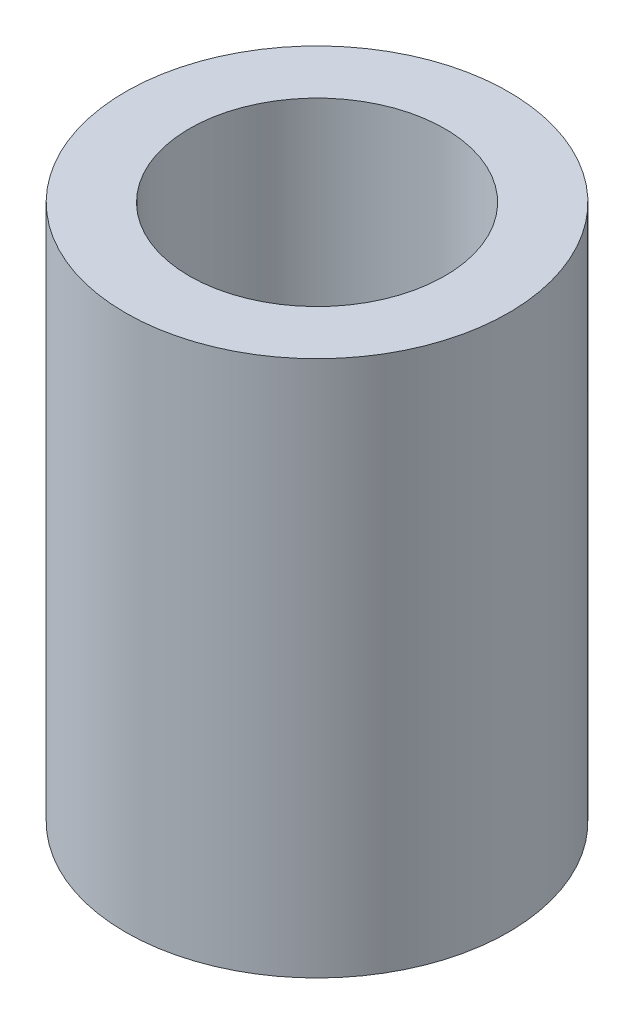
ISO-10303-21;
HEADER;
FILE_DESCRIPTION(('STEP AP214'),'2;1');
FILE_NAME('part.step','',(''),(''),'','','');
FILE_SCHEMA(('AUTOMOTIVE_DESIGN { 1 0 10303 214 1 1 1 1 }'));
ENDSEC;
DATA;
#1=APPLICATION_CONTEXT('core data for automotive mechanical design processes');
#2=APPLICATION_PROTOCOL_DEFINITION('international standard','automotive_design',2000,#1);
#3=PRODUCT_CONTEXT('',#1,'mechanical');
#4=PRODUCT('Part','Part','',(#3));
#5=PRODUCT_RELATED_PRODUCT_CATEGORY('part','',(#4));
#6=PRODUCT_DEFINITION_FORMATION('','',#4);
#7=PRODUCT_DEFINITION_CONTEXT('part definition',#1,'design');
#8=PRODUCT_DEFINITION('design','',#6,#7);
#9=PRODUCT_DEFINITION_SHAPE('','',#8);
#10=(LENGTH_UNIT() NAMED_UNIT(*) SI_UNIT(.MILLI.,.METRE.));
#11=(NAMED_UNIT(*) PLANE_ANGLE_UNIT() SI_UNIT($,.RADIAN.));
#12=(NAMED_UNIT(*) SI_UNIT($,.STERADIAN.) SOLID_ANGLE_UNIT());
#13=UNCERTAINTY_MEASURE_WITH_UNIT(LENGTH_MEASURE(1.E-05),#10,'distance_accuracy_value','');
#14=(GEOMETRIC_REPRESENTATION_CONTEXT(3) GLOBAL_UNCERTAINTY_ASSIGNED_CONTEXT((#13)) GLOBAL_UNIT_ASSIGNED_CONTEXT((#10,
#11,#12)) REPRESENTATION_CONTEXT('',''));
#15=CARTESIAN_POINT('',(0.,0.,0.));
#16=DIRECTION('',(0.,0.,1.));
#17=DIRECTION('',(1.,0.,0.));
#18=AXIS2_PLACEMENT_3D('',#15,#16,#17);
#19=CARTESIAN_POINT('',(0.,4.2,0.));
#20=DIRECTION('',(0.,1.,0.));
#21=DIRECTION('',(0.,0.,1.));
#22=AXIS2_PLACEMENT_3D('',#19,#20,#21);
#23=PLANE('',#22);
#24=CARTESIAN_POINT('',(0.,4.2,0.));
#25=DIRECTION('',(0.,1.,0.));
#26=DIRECTION('',(0.,0.,1.));
#27=AXIS2_PLACEMENT_3D('',#24,#25,#26);
#28=CIRCLE('',#27,1.5);
#29=CARTESIAN_POINT('',(0.,4.2,1.5));
#30=VERTEX_POINT('',#29);
#31=EDGE_CURVE('E10',#30,#30,#28,.T.);
#32=ORIENTED_EDGE('',*,*,#31,.T.);
#33=EDGE_LOOP('',(#32));
#34=FACE_BOUND('',#33,.T.);
#35=CARTESIAN_POINT('',(0.,4.2,0.));
#36=DIRECTION('',(0.,1.,0.));
#37=DIRECTION('',(0.,0.,1.));
#38=AXIS2_PLACEMENT_3D('',#35,#36,#37);
#39=CIRCLE('',#38,1.);
#40=CARTESIAN_POINT('',(0.,4.2,1.));
#41=VERTEX_POINT('',#40);
#42=EDGE_CURVE('E43',#41,#41,#39,.T.);
#43=ORIENTED_EDGE('',*,*,#42,.F.);
#44=EDGE_LOOP('',(#43));
#45=FACE_BOUND('',#44,.T.);
#46=ADVANCED_FACE('F32',(#34,#45),#23,.T.);
#47=CARTESIAN_POINT('',(0.,0.,0.));
#48=DIRECTION('',(0.,1.,0.));
#49=DIRECTION('',(0.,0.,1.));
#50=AXIS2_PLACEMENT_3D('',#47,#48,#49);
#51=PLANE('',#50);
#52=CARTESIAN_POINT('',(0.,0.,0.));
#53=DIRECTION('',(0.,1.,0.));
#54=DIRECTION('',(0.,0.,1.));
#55=AXIS2_PLACEMENT_3D('',#52,#53,#54);
#56=CIRCLE('',#55,1.5);
#57=CARTESIAN_POINT('',(0.,0.,1.5));
#58=VERTEX_POINT('',#57);
#59=EDGE_CURVE('E36',#58,#58,#56,.T.);
#60=ORIENTED_EDGE('',*,*,#59,.F.);
#61=EDGE_LOOP('',(#60));
#62=FACE_BOUND('',#61,.T.);
#63=CARTESIAN_POINT('',(0.,0.,0.));
#64=DIRECTION('',(0.,1.,0.));
#65=DIRECTION('',(0.,0.,1.));
#66=AXIS2_PLACEMENT_3D('',#63,#64,#65);
#67=CIRCLE('',#66,1.);
#68=CARTESIAN_POINT('',(0.,0.,1.));
#69=VERTEX_POINT('',#68);
#70=EDGE_CURVE('E45',#69,#69,#67,.T.);
#71=ORIENTED_EDGE('',*,*,#70,.T.);
#72=EDGE_LOOP('',(#71));
#73=FACE_BOUND('',#72,.T.);
#74=ADVANCED_FACE('F55',(#62,#73),#51,.F.);
#75=CARTESIAN_POINT('',(0.,4.2,0.));
#76=DIRECTION('',(0.,-1.,0.));
#77=DIRECTION('',(0.,0.,-1.));
#78=AXIS2_PLACEMENT_3D('',#75,#76,#77);
#79=CYLINDRICAL_SURFACE('',#78,1.5);
#80=ORIENTED_EDGE('',*,*,#31,.F.);
#81=EDGE_LOOP('',(#80));
#82=FACE_BOUND('',#81,.T.);
#83=ORIENTED_EDGE('',*,*,#59,.T.);
#84=EDGE_LOOP('',(#83));
#85=FACE_BOUND('',#84,.T.);
#86=ADVANCED_FACE('F34',(#82,#85),#79,.T.);
#87=CARTESIAN_POINT('',(0.,4.2,0.));
#88=DIRECTION('',(0.,-1.,0.));
#89=DIRECTION('',(0.,0.,-1.));
#90=AXIS2_PLACEMENT_3D('',#87,#88,#89);
#91=CYLINDRICAL_SURFACE('',#90,1.);
#92=ORIENTED_EDGE('',*,*,#42,.T.);
#93=EDGE_LOOP('',(#92));
#94=FACE_BOUND('',#93,.T.);
#95=ORIENTED_EDGE('',*,*,#70,.F.);
#96=EDGE_LOOP('',(#95));
#97=FACE_BOUND('',#96,.T.);
#98=ADVANCED_FACE('F51',(#94,#97),#91,.F.);
#99=CLOSED_SHELL('',(#46,#74,#86,#98));
#100=MANIFOLD_SOLID_BREP('B2',#99);
#101=ADVANCED_BREP_SHAPE_REPRESENTATION('',(#18,#100),#14);
#102=SHAPE_DEFINITION_REPRESENTATION(#9,#101);
ENDSEC;
END-ISO-10303-21;
